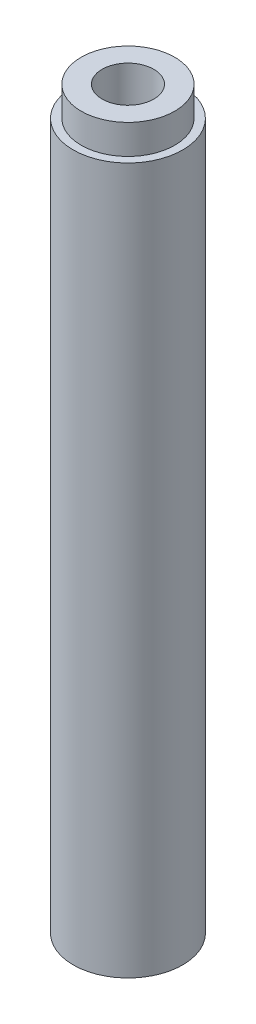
from build123d import *

# Parameters (mm, degrees)
SKETCH1_R           = 5.6515
BOSS_EXTRUDE1_DEPTH = 75.8698
SKETCH2_R           = 5.6515
SKETCH2_R_2         = 4.826
CUT_EXTRUDE1_DEPTH  = 3.048
SKETCH3_R           = 2.667
CUT_EXTRUDE2_DEPTH  = 24.257
CUT_EXTRUDE3_START  = -24.257
SKETCH4_R           = 2.667
CUT_EXTRUDE3_DEPTH  = 24.257


with BuildPart() as part:
    # Sketch1 → Boss-Extrude1 (new body)
    with BuildSketch(Plane(origin=(0, 0, 0), x_dir=(1, 0, 0), z_dir=(0, 1, 0))):
        with Locations(Location((0, 0, 0), (0, 0, 270))):
            Circle(SKETCH1_R)
    extrude(amount=-BOSS_EXTRUDE1_DEPTH)

    # Sketch2 → Cut-Extrude1 (cut)
    with BuildSketch(Plane(origin=(0, 0, 0), x_dir=(1, 0, 0), z_dir=(0, 1, 0))):
        with Locations(Location((0, 0, 0), (0, 0, 270))):
            Circle(SKETCH2_R)
        with Locations(Location((0, 0, 0), (0, 0, 270))):
            Circle(SKETCH2_R_2, mode=Mode.SUBTRACT)
    extrude(amount=-CUT_EXTRUDE1_DEPTH, mode=Mode.SUBTRACT)

    # Sketch3 → Cut-Extrude2 (cut)
    with BuildSketch(Plane(origin=(0, 0, 0), x_dir=(1, 0, 0), z_dir=(0, 1, 0))):
        with Locations(Location((0, 0, 0), (0, 0, 270))):
            Circle(SKETCH3_R)
    extrude(amount=-CUT_EXTRUDE2_DEPTH, mode=Mode.SUBTRACT)

    # Sketch4 → Cut-Extrude3 (cut)
    with BuildSketch(Plane.XZ.offset(75.8698).offset(CUT_EXTRUDE3_START)):
        with Locations(Location((0, 0, 0), (0, 0, 90))):
            Circle(SKETCH4_R)
    extrude(amount=CUT_EXTRUDE3_DEPTH, mode=Mode.SUBTRACT)


solid = part.part
